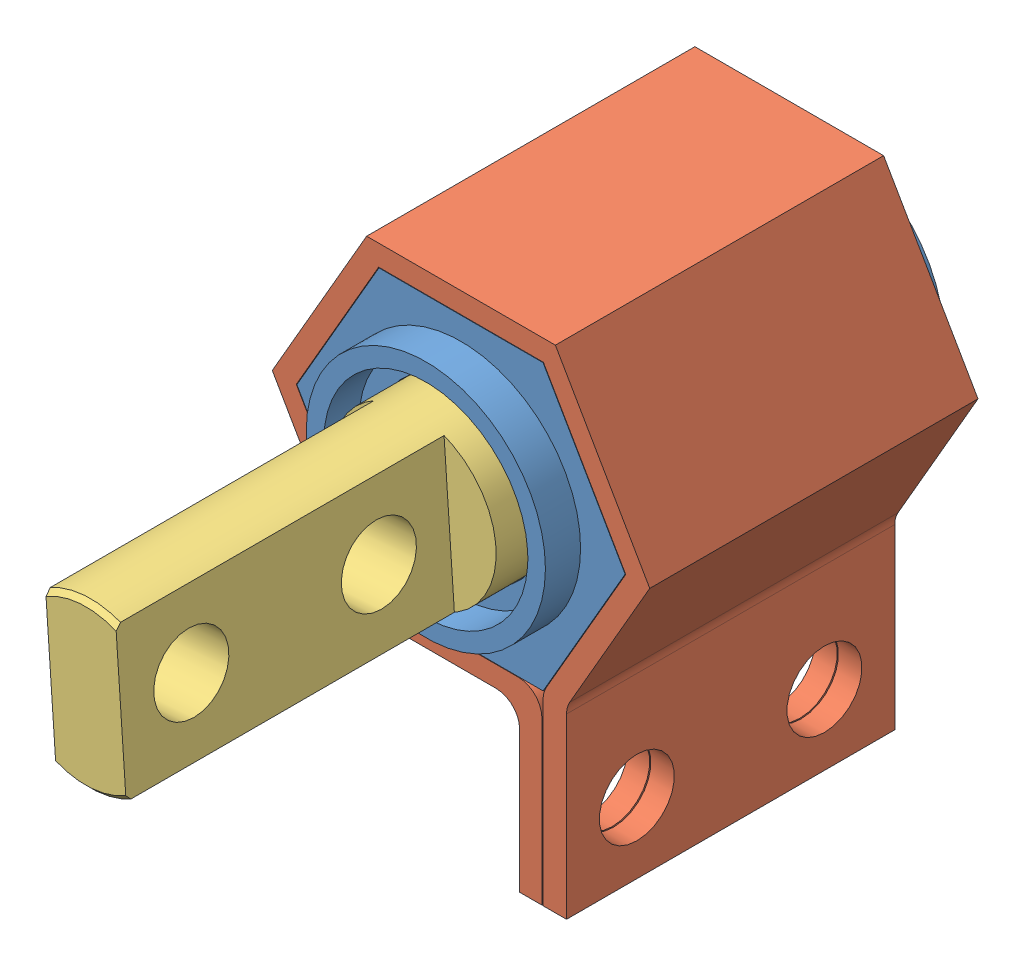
SolidWorks assembly KH72B125-150L.SLDASM, configuration Default (file format 10000). Lengths in mm.
Overall size (16.1 20.97 31.5).
3 component instances, 3 part files, 5 mates.
Components (placement in the parent):
- KH71-72 125-150 kgf Plastic Hex Body-1: KH71-72 125-150 kgf Plastic Hex Body.SLDPRT [Default] at origin size (14 12.12 17)
- KH71-72 kgf150 Hex housing-2: KH71-72 kgf150 Hex housing.SLDPRT [Default] at origin size (16.1 20.97 14)
- KH72 125-150 kgf two hole shaft-1: KH72 125-150 kgf two hole shaft.SLDPRT [Default] at (0 0 16) x (0.997575 0.069605 0) z (0.069605 -0.997575 0) size (7 27.5 7)
Mates (geometry in assembly coordinates):
- Width1: width anti-aligned: plane of KH71-72 125-150 kgf Plastic Hex Body-1 through (7 0 14) normal (0.866025 0.5 0); plane of KH71-72 125-150 kgf Plastic Hex Body-1 through (-7 0 14) normal (-0.866025 -0.5 0); plane of KH71-72 kgf150 Hex housing-2 through (7.025 0 14) normal (-0.866025 -0.5 0); plane of KH71-72 kgf150 Hex housing-2 through (-7.025 0 14) normal (0.866025 0.5 0)
- Width2: width anti-aligned: plane of KH71-72 125-150 kgf Plastic Hex Body-1 through (3.5 6.0622 14) normal (0 1 0); plane of KH71-72 125-150 kgf Plastic Hex Body-1 through (-3.5 -6.0622 14) normal (0 -1 0); plane of KH71-72 kgf150 Hex housing-2 through (3.5125 6.0838 14) normal (0 -1 0); plane of KH71-72 kgf150 Hex housing-2 through (-3.5125 -6.0838 14) normal (0 1 0)
- Coincident2: coincident aligned: plane of KH71-72 125-150 kgf Plastic Hex Body-1 through (0 0 0) normal (0 0 -1); plane of KH71-72 kgf150 Hex housing-2 through (1.5 -7.9715 0) normal (0 0 -1)
- Concentric2: concentric aligned: cylinder of KH71-72 125-150 kgf Plastic Hex Body-1 through (0 0 2.5) axis (0 0 1) radius 3.525; cylinder of KH72 125-150 kgf two hole shaft-1 through (0 0 2.5) axis (0 0 1) radius 3.5
- Coincident3: coincident anti-aligned: plane of KH71-72 125-150 kgf Plastic Hex Body-1 through (0 0 2.5) normal (0 0 1); plane of KH72 125-150 kgf two hole shaft-1 through (0 0 2.5) normal (0 0 -1)
